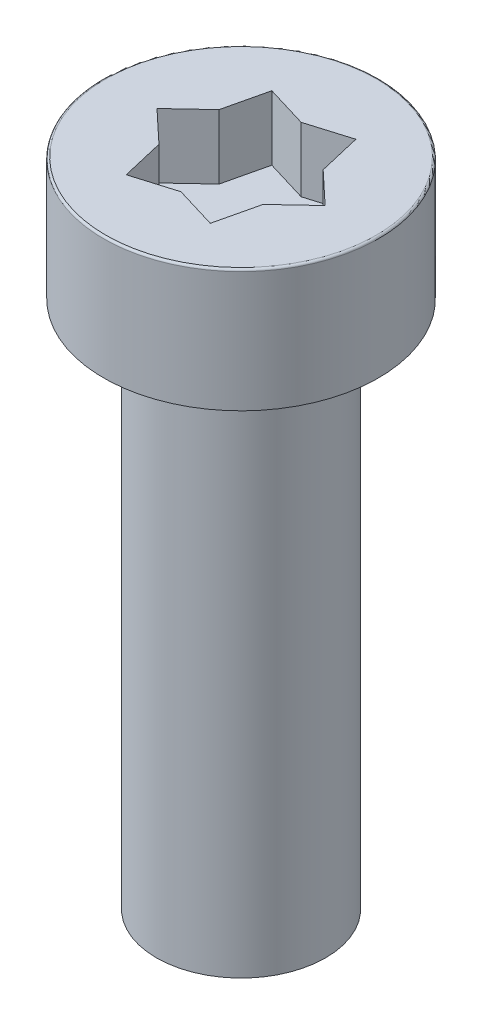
ISO-10303-21;
HEADER;
FILE_DESCRIPTION(('STEP AP214'),'2;1');
FILE_NAME('part.step','',(''),(''),'','','');
FILE_SCHEMA(('AUTOMOTIVE_DESIGN { 1 0 10303 214 1 1 1 1 }'));
ENDSEC;
DATA;
#1=APPLICATION_CONTEXT('core data for automotive mechanical design processes');
#2=APPLICATION_PROTOCOL_DEFINITION('international standard','automotive_design',2000,#1);
#3=PRODUCT_CONTEXT('',#1,'mechanical');
#4=PRODUCT('Part','Part','',(#3));
#5=PRODUCT_RELATED_PRODUCT_CATEGORY('part','',(#4));
#6=PRODUCT_DEFINITION_FORMATION('','',#4);
#7=PRODUCT_DEFINITION_CONTEXT('part definition',#1,'design');
#8=PRODUCT_DEFINITION('design','',#6,#7);
#9=PRODUCT_DEFINITION_SHAPE('','',#8);
#10=(LENGTH_UNIT() NAMED_UNIT(*) SI_UNIT(.MILLI.,.METRE.));
#11=(NAMED_UNIT(*) PLANE_ANGLE_UNIT() SI_UNIT($,.RADIAN.));
#12=(NAMED_UNIT(*) SI_UNIT($,.STERADIAN.) SOLID_ANGLE_UNIT());
#13=UNCERTAINTY_MEASURE_WITH_UNIT(LENGTH_MEASURE(1.E-05),#10,'distance_accuracy_value','');
#14=(GEOMETRIC_REPRESENTATION_CONTEXT(3) GLOBAL_UNCERTAINTY_ASSIGNED_CONTEXT((#13)) GLOBAL_UNIT_ASSIGNED_CONTEXT((#10,
#11,#12)) REPRESENTATION_CONTEXT('',''));
#15=CARTESIAN_POINT('',(0.,0.,0.));
#16=DIRECTION('',(0.,0.,1.));
#17=DIRECTION('',(1.,0.,0.));
#18=AXIS2_PLACEMENT_3D('',#15,#16,#17);
#19=CARTESIAN_POINT('',(1.98749999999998,27.75,3.44245098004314));
#20=DIRECTION('',(0.,1.,0.));
#21=DIRECTION('',(0.,0.,1.));
#22=AXIS2_PLACEMENT_3D('',#19,#20,#21);
#23=PLANE('',#22);
#24=DIRECTION('',(0.957327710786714,0.,0.289004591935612));
#25=VECTOR('',#24,1.);
#26=CARTESIAN_POINT('',(-1.98749999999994,27.7500000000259,-3.44245098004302));
#27=LINE('',#26,#25);
#28=CARTESIAN_POINT('',(-1.98749999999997,27.750000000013,-3.44245098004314));
#29=VERTEX_POINT('',#28);
#30=CARTESIAN_POINT('',(0.,27.750000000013,-2.84245098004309));
#31=VERTEX_POINT('',#30);
#32=EDGE_CURVE('E99',#29,#31,#27,.T.);
#33=ORIENTED_EDGE('',*,*,#32,.F.);
#34=DIRECTION('',(0.228378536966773,0.,-0.9735724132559));
#35=VECTOR('',#34,1.);
#36=CARTESIAN_POINT('',(-2.46163475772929,27.7500000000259,-1.42122549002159));
#37=LINE('',#36,#35);
#38=CARTESIAN_POINT('',(-2.46163475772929,27.750000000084,-1.42122549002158));
#39=VERTEX_POINT('',#38);
#40=EDGE_CURVE('E252',#39,#29,#37,.T.);
#41=ORIENTED_EDGE('',*,*,#40,.F.);
#42=DIRECTION('',(0.72894917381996,0.,-0.684567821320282));
#43=VECTOR('',#42,1.);
#44=CARTESIAN_POINT('',(-3.97499999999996,27.7500000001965,0.));
#45=LINE('',#44,#43);
#46=CARTESIAN_POINT('',(-3.97500000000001,27.750000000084,0.));
#47=VERTEX_POINT('',#46);
#48=EDGE_CURVE('E246',#47,#39,#45,.T.);
#49=ORIENTED_EDGE('',*,*,#48,.F.);
#50=DIRECTION('',(-0.728949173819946,0.,-0.684567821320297));
#51=VECTOR('',#50,1.);
#52=CARTESIAN_POINT('',(-2.46163475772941,27.7500000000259,1.42122549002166));
#53=LINE('',#52,#51);
#54=CARTESIAN_POINT('',(-2.46163475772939,27.7499999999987,1.42122549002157));
#55=VERTEX_POINT('',#54);
#56=EDGE_CURVE('E240',#55,#47,#53,.T.);
#57=ORIENTED_EDGE('',*,*,#56,.F.);
#58=DIRECTION('',(-0.228378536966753,0.,-0.973572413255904));
#59=VECTOR('',#58,1.);
#60=CARTESIAN_POINT('',(-1.98750000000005,27.7499999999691,3.44245098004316));
#61=LINE('',#60,#59);
#62=CARTESIAN_POINT('',(-1.98750000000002,27.7499999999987,3.44245098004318));
#63=VERTEX_POINT('',#62);
#64=EDGE_CURVE('E234',#63,#55,#61,.T.);
#65=ORIENTED_EDGE('',*,*,#64,.F.);
#66=DIRECTION('',(-0.957327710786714,0.,0.289004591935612));
#67=VECTOR('',#66,1.);
#68=CARTESIAN_POINT('',(0.,27.7500000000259,2.84245098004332));
#69=LINE('',#68,#67);
#70=CARTESIAN_POINT('',(0.,27.7499999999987,2.84245098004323));
#71=VERTEX_POINT('',#70);
#72=EDGE_CURVE('E228',#71,#63,#69,.T.);
#73=ORIENTED_EDGE('',*,*,#72,.F.);
#74=DIRECTION('',(-0.957327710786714,0.,-0.289004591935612));
#75=VECTOR('',#74,1.);
#76=CARTESIAN_POINT('',(1.98749999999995,27.7499999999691,3.44245098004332));
#77=LINE('',#76,#75);
#78=CARTESIAN_POINT('',(1.98749999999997,27.7499999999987,3.44245098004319));
#79=VERTEX_POINT('',#78);
#80=EDGE_CURVE('E222',#79,#71,#77,.T.);
#81=ORIENTED_EDGE('',*,*,#80,.F.);
#82=DIRECTION('',(-0.228378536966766,0.,0.973572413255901));
#83=VECTOR('',#82,1.);
#84=CARTESIAN_POINT('',(2.46163475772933,27.7500000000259,1.42122549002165));
#85=LINE('',#84,#83);
#86=CARTESIAN_POINT('',(2.46163475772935,27.750000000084,1.42122549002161));
#87=VERTEX_POINT('',#86);
#88=EDGE_CURVE('E216',#87,#79,#85,.T.);
#89=ORIENTED_EDGE('',*,*,#88,.F.);
#90=DIRECTION('',(-0.728949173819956,0.,0.684567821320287));
#91=VECTOR('',#90,1.);
#92=CARTESIAN_POINT('',(3.97500000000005,27.7500000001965,1.56339750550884E-13));
#93=LINE('',#92,#91);
#94=CARTESIAN_POINT('',(3.97500000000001,27.750000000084,0.));
#95=VERTEX_POINT('',#94);
#96=EDGE_CURVE('E211',#95,#87,#93,.T.);
#97=ORIENTED_EDGE('',*,*,#96,.F.);
#98=DIRECTION('',(0.728949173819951,0.,0.684567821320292));
#99=VECTOR('',#98,1.);
#100=CARTESIAN_POINT('',(2.46163475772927,27.7500000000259,-1.42122549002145));
#101=LINE('',#100,#99);
#102=CARTESIAN_POINT('',(2.4616347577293,27.750000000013,-1.42122549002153));
#103=VERTEX_POINT('',#102);
#104=EDGE_CURVE('E84',#103,#95,#101,.T.);
#105=ORIENTED_EDGE('',*,*,#104,.F.);
#106=DIRECTION('',(0.228378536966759,0.,0.973572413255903));
#107=VECTOR('',#106,1.);
#108=CARTESIAN_POINT('',(1.98750000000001,27.7500000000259,-3.44245098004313));
#109=LINE('',#108,#107);
#110=CARTESIAN_POINT('',(1.98750000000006,27.750000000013,-3.44245098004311));
#111=VERTEX_POINT('',#110);
#112=EDGE_CURVE('E81',#111,#103,#109,.T.);
#113=ORIENTED_EDGE('',*,*,#112,.F.);
#114=DIRECTION('',(0.957327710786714,0.,-0.289004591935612));
#115=VECTOR('',#114,1.);
#116=CARTESIAN_POINT('',(0.,27.7500000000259,-2.84245098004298));
#117=LINE('',#116,#115);
#118=EDGE_CURVE('E78',#31,#111,#117,.T.);
#119=ORIENTED_EDGE('',*,*,#118,.F.);
#120=EDGE_LOOP('',(#33,#41,#49,#57,#65,#73,#81,#89,#97,#105,#113,#119));
#121=FACE_BOUND('',#120,.T.);
#122=ADVANCED_FACE('F17',(#121),#23,.T.);
#123=CARTESIAN_POINT('',(1.98750000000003,-500000.,-3.44245098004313));
#124=DIRECTION('',(-0.973572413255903,0.,0.228378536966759));
#125=DIRECTION('',(0.228378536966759,0.,0.973572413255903));
#126=AXIS2_PLACEMENT_3D('',#123,#124,#125);
#127=PLANE('',#126);
#128=DIRECTION('',(-0.228378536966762,0.,-0.973572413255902));
#129=VECTOR('',#128,1.);
#130=CARTESIAN_POINT('',(2.46163475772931,30.8,-1.42122549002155));
#131=LINE('',#130,#129);
#132=CARTESIAN_POINT('',(2.46163475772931,30.7999999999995,-1.42122549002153));
#133=VERTEX_POINT('',#132);
#134=CARTESIAN_POINT('',(1.98750000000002,30.7999999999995,-3.4424509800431));
#135=VERTEX_POINT('',#134);
#136=EDGE_CURVE('E95',#133,#135,#131,.T.);
#137=ORIENTED_EDGE('',*,*,#136,.T.);
#138=DIRECTION('',(0.,1.,0.));
#139=VECTOR('',#138,1.);
#140=CARTESIAN_POINT('',(1.98750000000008,-500000.,-3.44245098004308));
#141=LINE('',#140,#139);
#142=EDGE_CURVE('E91',#111,#135,#141,.T.);
#143=ORIENTED_EDGE('',*,*,#142,.F.);
#144=ORIENTED_EDGE('',*,*,#112,.T.);
#145=DIRECTION('',(0.,1.,0.));
#146=VECTOR('',#145,1.);
#147=CARTESIAN_POINT('',(2.46163475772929,-500000.,-1.42122549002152));
#148=LINE('',#147,#146);
#149=EDGE_CURVE('E157',#133,#103,#148,.F.);
#150=ORIENTED_EDGE('',*,*,#149,.F.);
#151=EDGE_LOOP('',(#137,#143,#144,#150));
#152=FACE_BOUND('',#151,.T.);
#153=ADVANCED_FACE('F92',(#152),#127,.T.);
#154=CARTESIAN_POINT('',(0.,-500000.,-2.84245098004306));
#155=DIRECTION('',(0.289004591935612,0.,0.957327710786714));
#156=DIRECTION('',(0.957327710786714,0.,-0.289004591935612));
#157=AXIS2_PLACEMENT_3D('',#154,#155,#156);
#158=PLANE('',#157);
#159=DIRECTION('',(-0.957327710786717,0.,0.289004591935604));
#160=VECTOR('',#159,1.);
#161=CARTESIAN_POINT('',(1.98749999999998,30.8,-3.44245098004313));
#162=LINE('',#161,#160);
#163=CARTESIAN_POINT('',(0.,30.7999999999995,-2.84245098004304));
#164=VERTEX_POINT('',#163);
#165=EDGE_CURVE('E155',#135,#164,#162,.T.);
#166=ORIENTED_EDGE('',*,*,#165,.T.);
#167=DIRECTION('',(0.,1.,0.));
#168=VECTOR('',#167,1.);
#169=CARTESIAN_POINT('',(0.,-500000.,-2.84245098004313));
#170=LINE('',#169,#168);
#171=EDGE_CURVE('E103',#31,#164,#170,.T.);
#172=ORIENTED_EDGE('',*,*,#171,.F.);
#173=ORIENTED_EDGE('',*,*,#118,.T.);
#174=ORIENTED_EDGE('',*,*,#142,.T.);
#175=EDGE_LOOP('',(#166,#172,#173,#174));
#176=FACE_BOUND('',#175,.T.);
#177=ADVANCED_FACE('F101',(#176),#158,.T.);
#178=CARTESIAN_POINT('',(-1.98749999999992,-500000.,-3.4424509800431));
#179=DIRECTION('',(-0.289004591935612,0.,0.957327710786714));
#180=DIRECTION('',(0.957327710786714,0.,0.289004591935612));
#181=AXIS2_PLACEMENT_3D('',#178,#179,#180);
#182=PLANE('',#181);
#183=DIRECTION('',(-0.957327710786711,0.,-0.289004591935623));
#184=VECTOR('',#183,1.);
#185=CARTESIAN_POINT('',(0.,30.8,-2.84245098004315));
#186=LINE('',#185,#184);
#187=CARTESIAN_POINT('',(-1.98749999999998,30.7999999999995,-3.44245098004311));
#188=VERTEX_POINT('',#187);
#189=EDGE_CURVE('E152',#164,#188,#186,.T.);
#190=ORIENTED_EDGE('',*,*,#189,.T.);
#191=DIRECTION('',(0.,1.,0.));
#192=VECTOR('',#191,1.);
#193=CARTESIAN_POINT('',(-1.98749999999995,-500000.,-3.44245098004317));
#194=LINE('',#193,#192);
#195=EDGE_CURVE('E249',#29,#188,#194,.T.);
#196=ORIENTED_EDGE('',*,*,#195,.F.);
#197=ORIENTED_EDGE('',*,*,#32,.T.);
#198=ORIENTED_EDGE('',*,*,#171,.T.);
#199=EDGE_LOOP('',(#190,#196,#197,#198));
#200=FACE_BOUND('',#199,.T.);
#201=ADVANCED_FACE('F257',(#200),#182,.T.);
#202=CARTESIAN_POINT('',(-2.46163475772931,-500000.,-1.42122549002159));
#203=DIRECTION('',(0.9735724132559,0.,0.228378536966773));
#204=DIRECTION('',(0.228378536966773,0.,-0.9735724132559));
#205=AXIS2_PLACEMENT_3D('',#202,#203,#204);
#206=PLANE('',#205);
#207=DIRECTION('',(-0.228378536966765,0.,0.973572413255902));
#208=VECTOR('',#207,1.);
#209=CARTESIAN_POINT('',(-1.98749999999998,30.8,-3.44245098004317));
#210=LINE('',#209,#208);
#211=CARTESIAN_POINT('',(-2.46163475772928,30.8000000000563,-1.42122549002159));
#212=VERTEX_POINT('',#211);
#213=EDGE_CURVE('E149',#188,#212,#210,.T.);
#214=ORIENTED_EDGE('',*,*,#213,.T.);
#215=DIRECTION('',(0.,1.,0.));
#216=VECTOR('',#215,1.);
#217=CARTESIAN_POINT('',(-2.46163475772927,-500000.,-1.42122549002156));
#218=LINE('',#217,#216);
#219=EDGE_CURVE('E243',#39,#212,#218,.T.);
#220=ORIENTED_EDGE('',*,*,#219,.F.);
#221=ORIENTED_EDGE('',*,*,#40,.T.);
#222=ORIENTED_EDGE('',*,*,#195,.T.);
#223=EDGE_LOOP('',(#214,#220,#221,#222));
#224=FACE_BOUND('',#223,.T.);
#225=ADVANCED_FACE('F263',(#224),#206,.T.);
#226=CARTESIAN_POINT('',(-3.97500000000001,-500000.,0.));
#227=DIRECTION('',(0.684567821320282,0.,0.72894917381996));
#228=DIRECTION('',(0.72894917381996,0.,-0.684567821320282));
#229=AXIS2_PLACEMENT_3D('',#226,#227,#228);
#230=PLANE('',#229);
#231=DIRECTION('',(-0.728949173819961,0.,0.684567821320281));
#232=VECTOR('',#231,1.);
#233=CARTESIAN_POINT('',(-2.46163475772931,30.8,-1.42122549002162));
#234=LINE('',#233,#232);
#235=CARTESIAN_POINT('',(-3.97499999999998,30.80000000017,0.));
#236=VERTEX_POINT('',#235);
#237=EDGE_CURVE('E146',#212,#236,#234,.T.);
#238=ORIENTED_EDGE('',*,*,#237,.T.);
#239=DIRECTION('',(0.,1.,0.));
#240=VECTOR('',#239,1.);
#241=CARTESIAN_POINT('',(-3.97500000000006,-500000.,0.));
#242=LINE('',#241,#240);
#243=EDGE_CURVE('E237',#47,#236,#242,.T.);
#244=ORIENTED_EDGE('',*,*,#243,.F.);
#245=ORIENTED_EDGE('',*,*,#48,.T.);
#246=ORIENTED_EDGE('',*,*,#219,.T.);
#247=EDGE_LOOP('',(#238,#244,#245,#246));
#248=FACE_BOUND('',#247,.T.);
#249=ADVANCED_FACE('F268',(#248),#230,.T.);
#250=CARTESIAN_POINT('',(-2.46163475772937,-500000.,1.42122549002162));
#251=DIRECTION('',(0.684567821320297,0.,-0.728949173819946));
#252=DIRECTION('',(-0.728949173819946,0.,-0.684567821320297));
#253=AXIS2_PLACEMENT_3D('',#250,#251,#252);
#254=PLANE('',#253);
#255=DIRECTION('',(0.728949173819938,0.,0.684567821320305));
#256=VECTOR('',#255,1.);
#257=CARTESIAN_POINT('',(-3.97500000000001,30.8,0.));
#258=LINE('',#257,#256);
#259=CARTESIAN_POINT('',(-2.46163475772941,30.7999999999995,1.42122549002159));
#260=VERTEX_POINT('',#259);
#261=EDGE_CURVE('E143',#236,#260,#258,.T.);
#262=ORIENTED_EDGE('',*,*,#261,.T.);
#263=DIRECTION('',(0.,1.,0.));
#264=VECTOR('',#263,1.);
#265=CARTESIAN_POINT('',(-2.46163475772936,-500000.,1.42122549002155));
#266=LINE('',#265,#264);
#267=EDGE_CURVE('E231',#55,#260,#266,.T.);
#268=ORIENTED_EDGE('',*,*,#267,.F.);
#269=ORIENTED_EDGE('',*,*,#56,.T.);
#270=ORIENTED_EDGE('',*,*,#243,.T.);
#271=EDGE_LOOP('',(#262,#268,#269,#270));
#272=FACE_BOUND('',#271,.T.);
#273=ADVANCED_FACE('F273',(#272),#254,.T.);
#274=CARTESIAN_POINT('',(-1.98750000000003,-500000.,3.44245098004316));
#275=DIRECTION('',(0.973572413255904,0.,-0.228378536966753));
#276=DIRECTION('',(-0.228378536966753,0.,-0.973572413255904));
#277=AXIS2_PLACEMENT_3D('',#274,#275,#276);
#278=PLANE('',#277);
#279=DIRECTION('',(0.228378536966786,0.,0.973572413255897));
#280=VECTOR('',#279,1.);
#281=CARTESIAN_POINT('',(-2.46163475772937,30.8,1.42122549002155));
#282=LINE('',#281,#280);
#283=CARTESIAN_POINT('',(-1.98750000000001,30.7999999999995,3.4424509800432));
#284=VERTEX_POINT('',#283);
#285=EDGE_CURVE('E140',#260,#284,#282,.T.);
#286=ORIENTED_EDGE('',*,*,#285,.T.);
#287=DIRECTION('',(0.,1.,0.));
#288=VECTOR('',#287,1.);
#289=CARTESIAN_POINT('',(-1.98749999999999,-500000.,3.44245098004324));
#290=LINE('',#289,#288);
#291=EDGE_CURVE('E225',#63,#284,#290,.T.);
#292=ORIENTED_EDGE('',*,*,#291,.F.);
#293=ORIENTED_EDGE('',*,*,#64,.T.);
#294=ORIENTED_EDGE('',*,*,#267,.T.);
#295=EDGE_LOOP('',(#286,#292,#293,#294));
#296=FACE_BOUND('',#295,.T.);
#297=ADVANCED_FACE('F277',(#296),#278,.T.);
#298=CARTESIAN_POINT('',(0.,-500000.,2.84245098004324));
#299=DIRECTION('',(-0.289004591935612,0.,-0.957327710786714));
#300=DIRECTION('',(-0.957327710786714,0.,0.289004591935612));
#301=AXIS2_PLACEMENT_3D('',#298,#299,#300);
#302=PLANE('',#301);
#303=DIRECTION('',(0.957327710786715,0.,-0.28900459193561));
#304=VECTOR('',#303,1.);
#305=CARTESIAN_POINT('',(-1.98749999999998,30.8,3.44245098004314));
#306=LINE('',#305,#304);
#307=CARTESIAN_POINT('',(0.,30.7999999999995,2.84245098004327));
#308=VERTEX_POINT('',#307);
#309=EDGE_CURVE('E137',#284,#308,#306,.T.);
#310=ORIENTED_EDGE('',*,*,#309,.T.);
#311=DIRECTION('',(0.,1.,0.));
#312=VECTOR('',#311,1.);
#313=CARTESIAN_POINT('',(0.,-500000.,2.84245098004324));
#314=LINE('',#313,#312);
#315=EDGE_CURVE('E219',#71,#308,#314,.T.);
#316=ORIENTED_EDGE('',*,*,#315,.F.);
#317=ORIENTED_EDGE('',*,*,#72,.T.);
#318=ORIENTED_EDGE('',*,*,#291,.T.);
#319=EDGE_LOOP('',(#310,#316,#317,#318));
#320=FACE_BOUND('',#319,.T.);
#321=ADVANCED_FACE('F282',(#320),#302,.T.);
#322=CARTESIAN_POINT('',(1.98749999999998,-500000.,3.44245098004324));
#323=DIRECTION('',(0.289004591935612,0.,-0.957327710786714));
#324=DIRECTION('',(-0.957327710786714,0.,-0.289004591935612));
#325=AXIS2_PLACEMENT_3D('',#322,#323,#324);
#326=PLANE('',#325);
#327=DIRECTION('',(0.957327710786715,0.,0.28900459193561));
#328=VECTOR('',#327,1.);
#329=CARTESIAN_POINT('',(0.,30.8,2.84245098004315));
#330=LINE('',#329,#328);
#331=CARTESIAN_POINT('',(1.98749999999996,30.7999999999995,3.44245098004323));
#332=VERTEX_POINT('',#331);
#333=EDGE_CURVE('E134',#308,#332,#330,.T.);
#334=ORIENTED_EDGE('',*,*,#333,.T.);
#335=DIRECTION('',(0.,1.,0.));
#336=VECTOR('',#335,1.);
#337=CARTESIAN_POINT('',(1.98749999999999,-500000.,3.44245098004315));
#338=LINE('',#337,#336);
#339=EDGE_CURVE('E213',#79,#332,#338,.T.);
#340=ORIENTED_EDGE('',*,*,#339,.F.);
#341=ORIENTED_EDGE('',*,*,#80,.T.);
#342=ORIENTED_EDGE('',*,*,#315,.T.);
#343=EDGE_LOOP('',(#334,#340,#341,#342));
#344=FACE_BOUND('',#343,.T.);
#345=ADVANCED_FACE('F286',(#344),#326,.T.);
#346=CARTESIAN_POINT('',(2.46163475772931,-500000.,1.42122549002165));
#347=DIRECTION('',(-0.973572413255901,0.,-0.228378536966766));
#348=DIRECTION('',(-0.228378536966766,0.,0.973572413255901));
#349=AXIS2_PLACEMENT_3D('',#346,#347,#348);
#350=PLANE('',#349);
#351=DIRECTION('',(0.228378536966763,0.,-0.973572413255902));
#352=VECTOR('',#351,1.);
#353=CARTESIAN_POINT('',(1.98749999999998,30.8,3.44245098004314));
#354=LINE('',#353,#352);
#355=CARTESIAN_POINT('',(2.46163475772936,30.8000000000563,1.42122549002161));
#356=VERTEX_POINT('',#355);
#357=EDGE_CURVE('E125',#332,#356,#354,.T.);
#358=ORIENTED_EDGE('',*,*,#357,.T.);
#359=DIRECTION('',(0.,1.,0.));
#360=VECTOR('',#359,1.);
#361=CARTESIAN_POINT('',(2.46163475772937,-500000.,1.42122549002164));
#362=LINE('',#361,#360);
#363=EDGE_CURVE('E206',#87,#356,#362,.T.);
#364=ORIENTED_EDGE('',*,*,#363,.F.);
#365=ORIENTED_EDGE('',*,*,#88,.T.);
#366=ORIENTED_EDGE('',*,*,#339,.T.);
#367=EDGE_LOOP('',(#358,#364,#365,#366));
#368=FACE_BOUND('',#367,.T.);
#369=ADVANCED_FACE('F288',(#368),#350,.T.);
#370=CARTESIAN_POINT('',(3.97500000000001,-500000.,1.11022302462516E-13));
#371=DIRECTION('',(-0.684567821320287,0.,-0.728949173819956));
#372=DIRECTION('',(-0.728949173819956,0.,0.684567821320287));
#373=AXIS2_PLACEMENT_3D('',#370,#371,#372);
#374=PLANE('',#373);
#375=DIRECTION('',(0.728949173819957,0.,-0.684567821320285));
#376=VECTOR('',#375,1.);
#377=CARTESIAN_POINT('',(2.46163475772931,30.8,1.42122549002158));
#378=LINE('',#377,#376);
#379=CARTESIAN_POINT('',(3.97500000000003,30.80000000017,0.));
#380=VERTEX_POINT('',#379);
#381=EDGE_CURVE('E119',#356,#380,#378,.T.);
#382=ORIENTED_EDGE('',*,*,#381,.T.);
#383=DIRECTION('',(0.,1.,0.));
#384=VECTOR('',#383,1.);
#385=CARTESIAN_POINT('',(3.97499999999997,-500000.,0.));
#386=LINE('',#385,#384);
#387=EDGE_CURVE('E204',#95,#380,#386,.T.);
#388=ORIENTED_EDGE('',*,*,#387,.F.);
#389=ORIENTED_EDGE('',*,*,#96,.T.);
#390=ORIENTED_EDGE('',*,*,#363,.T.);
#391=EDGE_LOOP('',(#382,#388,#389,#390));
#392=FACE_BOUND('',#391,.T.);
#393=ADVANCED_FACE('F202',(#392),#374,.T.);
#394=CARTESIAN_POINT('',(2.46163475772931,-500000.,-1.42122549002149));
#395=DIRECTION('',(-0.684567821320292,0.,0.728949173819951));
#396=DIRECTION('',(0.728949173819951,0.,0.684567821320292));
#397=AXIS2_PLACEMENT_3D('',#394,#395,#396);
#398=PLANE('',#397);
#399=DIRECTION('',(-0.728949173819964,0.,-0.684567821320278));
#400=VECTOR('',#399,1.);
#401=CARTESIAN_POINT('',(3.97500000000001,30.8,0.));
#402=LINE('',#401,#400);
#403=EDGE_CURVE('E117',#380,#133,#402,.T.);
#404=ORIENTED_EDGE('',*,*,#403,.T.);
#405=ORIENTED_EDGE('',*,*,#149,.T.);
#406=ORIENTED_EDGE('',*,*,#104,.T.);
#407=ORIENTED_EDGE('',*,*,#387,.T.);
#408=EDGE_LOOP('',(#404,#405,#406,#407));
#409=FACE_BOUND('',#408,.T.);
#410=ADVANCED_FACE('F192',(#409),#398,.T.);
#411=CARTESIAN_POINT('',(-6.50000000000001,30.8,0.));
#412=DIRECTION('',(0.,-1.,0.));
#413=DIRECTION('',(0.,0.,-1.));
#414=AXIS2_PLACEMENT_3D('',#411,#412,#413);
#415=PLANE('',#414);
#416=CARTESIAN_POINT('',(0.,30.8,0.));
#417=DIRECTION('',(0.,-1.,0.));
#418=DIRECTION('',(0.,0.,-1.));
#419=AXIS2_PLACEMENT_3D('',#416,#417,#418);
#420=CIRCLE('',#419,6.40000000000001);
#421=CARTESIAN_POINT('',(0.,30.8,-6.4));
#422=VERTEX_POINT('',#421);
#423=CARTESIAN_POINT('',(0.,30.8,6.4));
#424=VERTEX_POINT('',#423);
#425=EDGE_CURVE('E115',#422,#424,#420,.T.);
#426=ORIENTED_EDGE('',*,*,#425,.F.);
#427=CARTESIAN_POINT('',(0.,30.8,0.));
#428=DIRECTION('',(0.,-1.,0.));
#429=DIRECTION('',(0.,0.,1.));
#430=AXIS2_PLACEMENT_3D('',#427,#428,#429);
#431=CIRCLE('',#430,6.4);
#432=EDGE_CURVE('E36',#424,#422,#431,.T.);
#433=ORIENTED_EDGE('',*,*,#432,.F.);
#434=EDGE_LOOP('',(#426,#433));
#435=FACE_BOUND('',#434,.T.);
#436=ORIENTED_EDGE('',*,*,#381,.F.);
#437=ORIENTED_EDGE('',*,*,#357,.F.);
#438=ORIENTED_EDGE('',*,*,#333,.F.);
#439=ORIENTED_EDGE('',*,*,#309,.F.);
#440=ORIENTED_EDGE('',*,*,#285,.F.);
#441=ORIENTED_EDGE('',*,*,#261,.F.);
#442=ORIENTED_EDGE('',*,*,#237,.F.);
#443=ORIENTED_EDGE('',*,*,#213,.F.);
#444=ORIENTED_EDGE('',*,*,#189,.F.);
#445=ORIENTED_EDGE('',*,*,#165,.F.);
#446=ORIENTED_EDGE('',*,*,#136,.F.);
#447=ORIENTED_EDGE('',*,*,#403,.F.);
#448=EDGE_LOOP('',(#436,#437,#438,#439,#440,#441,#442,#443,#444,#445,#446,#447));
#449=FACE_BOUND('',#448,.T.);
#450=ADVANCED_FACE('F173',(#435,#449),#415,.F.);
#451=CARTESIAN_POINT('',(0.,30.7,0.));
#452=DIRECTION('',(0.,-1.,0.));
#453=DIRECTION('',(0.,0.,-1.));
#454=AXIS2_PLACEMENT_3D('',#451,#452,#453);
#455=TOROIDAL_SURFACE('',#454,6.4,0.1);
#456=CARTESIAN_POINT('',(0.,30.7,0.));
#457=DIRECTION('',(0.,-1.,0.));
#458=DIRECTION('',(0.,0.,-1.));
#459=AXIS2_PLACEMENT_3D('',#456,#457,#458);
#460=CIRCLE('',#459,6.50000000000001);
#461=CARTESIAN_POINT('',(0.,30.7,-6.50000000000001));
#462=VERTEX_POINT('',#461);
#463=EDGE_CURVE('E112',#462,#462,#460,.T.);
#464=ORIENTED_EDGE('',*,*,#463,.F.);
#465=EDGE_LOOP('',(#464));
#466=FACE_BOUND('',#465,.T.);
#467=ORIENTED_EDGE('',*,*,#425,.T.);
#468=ORIENTED_EDGE('',*,*,#432,.T.);
#469=EDGE_LOOP('',(#467,#468));
#470=FACE_BOUND('',#469,.T.);
#471=ADVANCED_FACE('F114',(#466,#470),#455,.T.);
#472=CARTESIAN_POINT('',(0.,0.,0.));
#473=DIRECTION('',(0.,-1.,0.));
#474=DIRECTION('',(0.,0.,-1.));
#475=AXIS2_PLACEMENT_3D('',#472,#473,#474);
#476=CYLINDRICAL_SURFACE('',#475,6.50000000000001);
#477=CARTESIAN_POINT('',(0.,25.,0.));
#478=DIRECTION('',(0.,-1.,0.));
#479=DIRECTION('',(0.,0.,-1.));
#480=AXIS2_PLACEMENT_3D('',#477,#478,#479);
#481=CIRCLE('',#480,6.50000000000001);
#482=CARTESIAN_POINT('',(0.,25.,-6.50000000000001));
#483=VERTEX_POINT('',#482);
#484=EDGE_CURVE('E110',#483,#483,#481,.F.);
#485=ORIENTED_EDGE('',*,*,#484,.T.);
#486=EDGE_LOOP('',(#485));
#487=FACE_BOUND('',#486,.T.);
#488=ORIENTED_EDGE('',*,*,#463,.T.);
#489=EDGE_LOOP('',(#488));
#490=FACE_BOUND('',#489,.T.);
#491=ADVANCED_FACE('F172',(#487,#490),#476,.T.);
#492=CARTESIAN_POINT('',(-4.,25.,0.));
#493=DIRECTION('',(0.,1.,0.));
#494=DIRECTION('',(0.,0.,1.));
#495=AXIS2_PLACEMENT_3D('',#492,#493,#494);
#496=PLANE('',#495);
#497=ORIENTED_EDGE('',*,*,#484,.F.);
#498=EDGE_LOOP('',(#497));
#499=FACE_BOUND('',#498,.T.);
#500=CARTESIAN_POINT('',(0.,25.,0.));
#501=DIRECTION('',(0.,-1.,0.));
#502=DIRECTION('',(0.,0.,-1.));
#503=AXIS2_PLACEMENT_3D('',#500,#501,#502);
#504=CIRCLE('',#503,4.);
#505=CARTESIAN_POINT('',(0.,25.,-4.));
#506=VERTEX_POINT('',#505);
#507=EDGE_CURVE('E28',#506,#506,#504,.T.);
#508=ORIENTED_EDGE('',*,*,#507,.F.);
#509=EDGE_LOOP('',(#508));
#510=FACE_BOUND('',#509,.T.);
#511=ADVANCED_FACE('F317',(#499,#510),#496,.F.);
#512=CARTESIAN_POINT('',(0.,0.,0.));
#513=DIRECTION('',(0.,1.,0.));
#514=DIRECTION('',(0.,0.,1.));
#515=AXIS2_PLACEMENT_3D('',#512,#513,#514);
#516=PLANE('',#515);
#517=CARTESIAN_POINT('',(0.,0.,0.));
#518=DIRECTION('',(0.,-1.,0.));
#519=DIRECTION('',(0.,0.,-1.));
#520=AXIS2_PLACEMENT_3D('',#517,#518,#519);
#521=CIRCLE('',#520,4.);
#522=CARTESIAN_POINT('',(0.,0.,-4.));
#523=VERTEX_POINT('',#522);
#524=EDGE_CURVE('E11',#523,#523,#521,.F.);
#525=ORIENTED_EDGE('',*,*,#524,.F.);
#526=EDGE_LOOP('',(#525));
#527=FACE_BOUND('',#526,.T.);
#528=ADVANCED_FACE('F311',(#527),#516,.F.);
#529=CARTESIAN_POINT('',(0.,0.,0.));
#530=DIRECTION('',(0.,-1.,0.));
#531=DIRECTION('',(0.,0.,-1.));
#532=AXIS2_PLACEMENT_3D('',#529,#530,#531);
#533=CYLINDRICAL_SURFACE('',#532,4.);
#534=ORIENTED_EDGE('',*,*,#524,.T.);
#535=EDGE_LOOP('',(#534));
#536=FACE_BOUND('',#535,.T.);
#537=ORIENTED_EDGE('',*,*,#507,.T.);
#538=EDGE_LOOP('',(#537));
#539=FACE_BOUND('',#538,.T.);
#540=ADVANCED_FACE('F309',(#536,#539),#533,.T.);
#541=CLOSED_SHELL('',(#122,#153,#177,#201,#225,#249,#273,#297,#321,#345,#369,#393,#410,#450,
#471,#491,#511,#528,#540));
#542=MANIFOLD_SOLID_BREP('B1',#541);
#543=ADVANCED_BREP_SHAPE_REPRESENTATION('',(#18,#542),#14);
#544=SHAPE_DEFINITION_REPRESENTATION(#9,#543);
ENDSEC;
END-ISO-10303-21;
